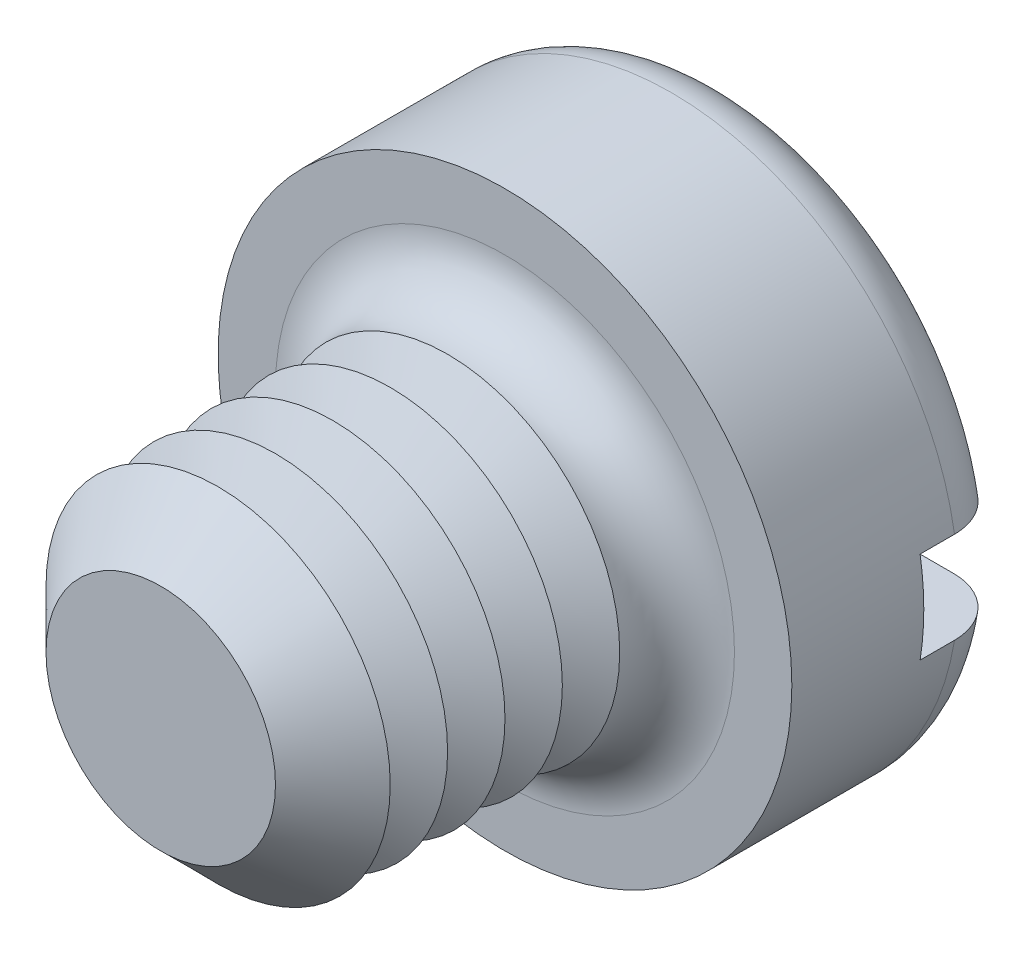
ISO-10303-21;
HEADER;
FILE_DESCRIPTION(('STEP AP214'),'2;1');
FILE_NAME('part.step','',(''),(''),'','','');
FILE_SCHEMA(('AUTOMOTIVE_DESIGN { 1 0 10303 214 1 1 1 1 }'));
ENDSEC;
DATA;
#1=APPLICATION_CONTEXT('core data for automotive mechanical design processes');
#2=APPLICATION_PROTOCOL_DEFINITION('international standard','automotive_design',2000,#1);
#3=PRODUCT_CONTEXT('',#1,'mechanical');
#4=PRODUCT('Part','Part','',(#3));
#5=PRODUCT_RELATED_PRODUCT_CATEGORY('part','',(#4));
#6=PRODUCT_DEFINITION_FORMATION('','',#4);
#7=PRODUCT_DEFINITION_CONTEXT('part definition',#1,'design');
#8=PRODUCT_DEFINITION('design','',#6,#7);
#9=PRODUCT_DEFINITION_SHAPE('','',#8);
#10=(LENGTH_UNIT() NAMED_UNIT(*) SI_UNIT(.MILLI.,.METRE.));
#11=(NAMED_UNIT(*) PLANE_ANGLE_UNIT() SI_UNIT($,.RADIAN.));
#12=(NAMED_UNIT(*) SI_UNIT($,.STERADIAN.) SOLID_ANGLE_UNIT());
#13=UNCERTAINTY_MEASURE_WITH_UNIT(LENGTH_MEASURE(1.E-05),#10,'distance_accuracy_value','');
#14=(GEOMETRIC_REPRESENTATION_CONTEXT(3) GLOBAL_UNCERTAINTY_ASSIGNED_CONTEXT((#13)) GLOBAL_UNIT_ASSIGNED_CONTEXT((#10,
#11,#12)) REPRESENTATION_CONTEXT('',''));
#15=CARTESIAN_POINT('',(0.,0.,0.));
#16=DIRECTION('',(0.,0.,1.));
#17=DIRECTION('',(1.,0.,0.));
#18=AXIS2_PLACEMENT_3D('',#15,#16,#17);
#19=CARTESIAN_POINT('',(0.,0.,-3.9));
#20=DIRECTION('',(0.,0.,1.));
#21=DIRECTION('',(1.,0.,0.));
#22=AXIS2_PLACEMENT_3D('',#19,#20,#21);
#23=PLANE('',#22);
#24=CARTESIAN_POINT('',(0.,0.,-3.9));
#25=DIRECTION('',(0.,0.,1.));
#26=DIRECTION('',(1.,0.,0.));
#27=AXIS2_PLACEMENT_3D('',#24,#25,#26);
#28=CIRCLE('',#27,4.);
#29=CARTESIAN_POINT('',(-3.91918358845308,0.800000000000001,-3.9));
#30=VERTEX_POINT('',#29);
#31=CARTESIAN_POINT('',(3.91918358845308,0.799999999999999,-3.9));
#32=VERTEX_POINT('',#31);
#33=EDGE_CURVE('E116',#30,#32,#28,.F.);
#34=ORIENTED_EDGE('',*,*,#33,.T.);
#35=DIRECTION('',(1.,0.,0.));
#36=VECTOR('',#35,1.);
#37=CARTESIAN_POINT('',(-5.,0.800000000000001,-3.9));
#38=LINE('',#37,#36);
#39=EDGE_CURVE('E111',#30,#32,#38,.T.);
#40=ORIENTED_EDGE('',*,*,#39,.F.);
#41=EDGE_LOOP('',(#34,#40));
#42=FACE_BOUND('',#41,.T.);
#43=ADVANCED_FACE('F39',(#42),#23,.F.);
#44=CARTESIAN_POINT('',(0.,0.,-2.9));
#45=DIRECTION('',(0.,0.,1.));
#46=DIRECTION('',(1.,0.,0.));
#47=AXIS2_PLACEMENT_3D('',#44,#45,#46);
#48=TOROIDAL_SURFACE('',#47,4.,1.);
#49=CARTESIAN_POINT('',(-4.76648512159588,0.800000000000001,-3.45304061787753));
#50=CARTESIAN_POINT('',(-4.73486405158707,0.800000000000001,-3.50001565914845));
#51=CARTESIAN_POINT('',(-4.69920787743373,0.800000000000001,-3.54432871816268));
#52=CARTESIAN_POINT('',(-4.62090302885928,0.800000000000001,-3.62634638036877));
#53=CARTESIAN_POINT('',(-4.57824494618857,0.800000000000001,-3.66404194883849));
#54=CARTESIAN_POINT('',(-4.48726975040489,0.800000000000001,-3.73172278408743));
#55=CARTESIAN_POINT('',(-4.43895902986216,0.800000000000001,-3.76171664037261));
#56=CARTESIAN_POINT('',(-4.33804923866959,0.800000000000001,-3.81326437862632));
#57=CARTESIAN_POINT('',(-4.2854512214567,0.800000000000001,-3.8348203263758));
#58=CARTESIAN_POINT('',(-4.17679895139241,0.800000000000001,-3.86918431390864));
#59=CARTESIAN_POINT('',(-4.12071163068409,0.800000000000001,-3.88188775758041));
#60=CARTESIAN_POINT('',(-4.00720729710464,0.800000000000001,-3.89785932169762));
#61=CARTESIAN_POINT('',(-3.94979011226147,0.800000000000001,-3.9011262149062));
#62=CARTESIAN_POINT('',(-3.83429042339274,0.800000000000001,-3.89816676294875));
#63=CARTESIAN_POINT('',(-3.77621176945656,0.8,-3.89178937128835));
#64=CARTESIAN_POINT('',(-3.66191938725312,0.8,-3.8694726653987));
#65=CARTESIAN_POINT('',(-3.60570580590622,0.8,-3.85353259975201));
#66=CARTESIAN_POINT('',(-3.49618749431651,0.8,-3.81233202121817));
#67=CARTESIAN_POINT('',(-3.44291561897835,0.8,-3.78698406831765));
#68=CARTESIAN_POINT('',(-3.34140774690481,0.8,-3.72766098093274));
#69=CARTESIAN_POINT('',(-3.29317182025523,0.8,-3.69368572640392));
#70=CARTESIAN_POINT('',(-3.20343355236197,0.8,-3.6182054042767));
#71=CARTESIAN_POINT('',(-3.16189680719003,0.8,-3.57674128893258));
#72=CARTESIAN_POINT('',(-3.08658236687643,0.8,-3.48727547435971));
#73=CARTESIAN_POINT('',(-3.05280364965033,0.8,-3.43927463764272));
#74=CARTESIAN_POINT('',(-2.99489532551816,0.8,-3.33932895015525));
#75=CARTESIAN_POINT('',(-2.97055012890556,0.8,-3.28750911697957));
#76=CARTESIAN_POINT('',(-2.93124252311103,0.8,-3.18042600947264));
#77=CARTESIAN_POINT('',(-2.91627793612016,0.8,-3.12516353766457));
#78=CARTESIAN_POINT('',(-2.89663075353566,0.8,-3.01470560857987));
#79=CARTESIAN_POINT('',(-2.89162828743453,0.8,-2.95956691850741));
#80=CARTESIAN_POINT('',(-2.89112479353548,0.8,-2.84924961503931));
#81=CARTESIAN_POINT('',(-2.89562264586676,0.8,-2.79407100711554));
#82=CARTESIAN_POINT('',(-2.91379565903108,0.8,-2.6861912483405));
#83=CARTESIAN_POINT('',(-2.92731815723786,0.8,-2.63346424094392));
#84=CARTESIAN_POINT('',(-2.96290888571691,0.8,-2.53098203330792));
#85=CARTESIAN_POINT('',(-2.98497757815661,0.8,-2.48122699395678));
#86=CARTESIAN_POINT('',(-3.03728055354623,0.8,-2.38535286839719));
#87=CARTESIAN_POINT('',(-3.06761989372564,0.8,-2.33929117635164));
#88=CARTESIAN_POINT('',(-3.13537950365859,0.8,-2.2527125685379));
#89=CARTESIAN_POINT('',(-3.17280082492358,0.8,-2.21219647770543));
#90=CARTESIAN_POINT('',(-3.2549164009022,0.8,-2.13651195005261));
#91=CARTESIAN_POINT('',(-3.29980186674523,0.8,-2.10155095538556));
#92=CARTESIAN_POINT('',(-3.39467666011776,0.8,-2.03942270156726));
#93=CARTESIAN_POINT('',(-3.44466673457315,0.8,-2.01225658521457));
#94=CARTESIAN_POINT('',(-3.5497933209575,0.8,-1.96576935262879));
#95=CARTESIAN_POINT('',(-3.60503228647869,0.8,-1.94667963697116));
#96=CARTESIAN_POINT('',(-3.71791613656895,0.8,-1.91794308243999));
#97=CARTESIAN_POINT('',(-3.77556119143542,0.800000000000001,-1.90829691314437));
#98=CARTESIAN_POINT('',(-3.89221522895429,0.800000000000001,-1.89869331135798));
#99=CARTESIAN_POINT('',(-3.9512319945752,0.800000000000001,-1.89882985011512));
#100=CARTESIAN_POINT('',(-4.06839541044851,0.800000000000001,-1.90907818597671));
#101=CARTESIAN_POINT('',(-4.12654207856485,0.800000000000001,-1.91918977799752));
#102=CARTESIAN_POINT('',(-4.23988103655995,0.800000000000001,-1.9490667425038));
#103=CARTESIAN_POINT('',(-4.29509069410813,0.800000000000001,-1.96876615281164));
#104=CARTESIAN_POINT('',(-4.40134194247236,0.800000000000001,-2.01729572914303));
#105=CARTESIAN_POINT('',(-4.45238383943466,0.800000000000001,-2.04612522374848));
#106=CARTESIAN_POINT('',(-4.54801343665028,0.800000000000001,-2.1116316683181));
#107=CARTESIAN_POINT('',(-4.59268768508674,0.800000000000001,-2.14818225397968));
#108=CARTESIAN_POINT('',(-4.67513924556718,0.800000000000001,-2.22837632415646));
#109=CARTESIAN_POINT('',(-4.71291715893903,0.800000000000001,-2.27201918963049));
#110=CARTESIAN_POINT('',(-4.77986554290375,0.800000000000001,-2.36439990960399));
#111=CARTESIAN_POINT('',(-4.80916462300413,0.800000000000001,-2.41304457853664));
#112=CARTESIAN_POINT('',(-4.85906149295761,0.800000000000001,-2.51460659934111));
#113=CARTESIAN_POINT('',(-4.8796602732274,0.800000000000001,-2.56752346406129));
#114=CARTESIAN_POINT('',(-4.9113264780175,0.800000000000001,-2.67542592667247));
#115=CARTESIAN_POINT('',(-4.92250819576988,0.800000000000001,-2.73037800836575));
#116=CARTESIAN_POINT('',(-4.93542682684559,0.800000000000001,-2.84139649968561));
#117=CARTESIAN_POINT('',(-4.93716171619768,0.800000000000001,-2.89746314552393));
#118=CARTESIAN_POINT('',(-4.93114851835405,0.800000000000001,-3.00876455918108));
#119=CARTESIAN_POINT('',(-4.92345325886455,0.800000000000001,-3.0640022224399));
#120=CARTESIAN_POINT('',(-4.8989032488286,0.800000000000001,-3.17235240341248));
#121=CARTESIAN_POINT('',(-4.88205998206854,0.800000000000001,-3.22546749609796));
#122=CARTESIAN_POINT('',(-4.84819200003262,0.800000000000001,-3.30764066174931));
#123=CARTESIAN_POINT('',(-4.83390853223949,0.800000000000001,-3.33785845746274));
#124=CARTESIAN_POINT('',(-4.80237957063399,0.800000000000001,-3.39670633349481));
#125=CARTESIAN_POINT('',(-4.78513409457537,0.800000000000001,-3.42533642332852));
#126=CARTESIAN_POINT('',(-4.76648512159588,0.800000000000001,-3.45304061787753));
#127=B_SPLINE_CURVE_WITH_KNOTS('',3,(#49,#50,#51,#52,#53,#54,#55,#56,#57,#58,#59,#60,#61,#62,
#63,#64,#65,#66,#67,#68,#69,#70,#71,#72,#73,#74,#75,#76,#77,#78,#79,#80,#81,#82,#83,#84,#85,#86,
#87,#88,#89,#90,#91,#92,#93,#94,#95,#96,#97,#98,#99,#100,#101,#102,#103,#104,#105,#106,#107,
#108,#109,#110,#111,#112,#113,#114,#115,#116,#117,#118,#119,#120,#121,#122,#123,#124,#125,#126),
.UNSPECIFIED.,.T.,.F.,(4,2,2,2,2,2,2,2,2,2,2,2,2,2,2,2,2,2,2,2,2,2,2,2,2,2,2,2,2,2,2,2,2,2,2,2,
2,2,4),(0.,0.169755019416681,0.339740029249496,0.509534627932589,0.67928763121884,
0.851013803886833,1.02276230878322,1.19722869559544,1.37170879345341,1.54785292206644,
1.72399950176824,1.89921049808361,2.07439839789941,2.24530597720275,2.41617386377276,
2.58146078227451,2.74672821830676,2.90926852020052,3.0718176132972,3.2365363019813,
3.40127946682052,3.57118676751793,3.74111896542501,3.91563534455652,4.09016409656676,
4.26636956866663,4.4425714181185,4.61757781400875,4.79257134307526,4.96489650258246,
5.13720662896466,5.30674670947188,5.47626748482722,5.64369988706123,5.81116816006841,
5.97770254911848,6.14402836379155,6.24414438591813,6.34425980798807),.UNSPECIFIED.);
#128=CARTESIAN_POINT('',(-4.93558507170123,0.800000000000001,-2.9));
#129=VERTEX_POINT('',#128);
#130=EDGE_CURVE('E211',#129,#30,#127,.T.);
#131=ORIENTED_EDGE('',*,*,#130,.F.);
#132=CARTESIAN_POINT('',(0.,0.,-2.9));
#133=DIRECTION('',(0.,0.,1.));
#134=DIRECTION('',(1.,0.,0.));
#135=AXIS2_PLACEMENT_3D('',#132,#133,#134);
#136=CIRCLE('',#135,5.);
#137=CARTESIAN_POINT('',(4.93558507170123,0.799999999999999,-2.9));
#138=VERTEX_POINT('',#137);
#139=EDGE_CURVE('E125',#138,#129,#136,.T.);
#140=ORIENTED_EDGE('',*,*,#139,.F.);
#141=CARTESIAN_POINT('',(2.98553785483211,0.8,-3.31649797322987));
#142=CARTESIAN_POINT('',(3.00991125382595,0.8,-3.36788093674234));
#143=CARTESIAN_POINT('',(3.03875556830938,0.8,-3.41719756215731));
#144=CARTESIAN_POINT('',(3.1043993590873,0.8,-3.51028676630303));
#145=CARTESIAN_POINT('',(3.1412115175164,0.8,-3.55405032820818));
#146=CARTESIAN_POINT('',(3.22153641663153,0.8,-3.63476402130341));
#147=CARTESIAN_POINT('',(3.26503706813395,0.8,-3.67172618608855));
#148=CARTESIAN_POINT('',(3.35749627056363,0.8,-3.73799476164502));
#149=CARTESIAN_POINT('',(3.4064533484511,0.8,-3.76730323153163));
#150=CARTESIAN_POINT('',(3.5095773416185,0.8,-3.81809642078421));
#151=CARTESIAN_POINT('',(3.56383317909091,0.8,-3.83940072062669));
#152=CARTESIAN_POINT('',(3.67513017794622,0.8,-3.87272481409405));
#153=CARTESIAN_POINT('',(3.7321717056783,0.799999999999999,-3.88474338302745));
#154=CARTESIAN_POINT('',(3.84815688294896,0.799999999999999,-3.89923413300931));
#155=CARTESIAN_POINT('',(3.90711516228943,0.799999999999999,-3.9015896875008));
#156=CARTESIAN_POINT('',(4.02458610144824,0.799999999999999,-3.89631753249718));
#157=CARTESIAN_POINT('',(4.08309876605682,0.799999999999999,-3.8886899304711));
#158=CARTESIAN_POINT('',(4.19768646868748,0.799999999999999,-3.86366584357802));
#159=CARTESIAN_POINT('',(4.25377243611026,0.799999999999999,-3.84631948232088));
#160=CARTESIAN_POINT('',(4.3621676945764,0.799999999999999,-3.80231797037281));
#161=CARTESIAN_POINT('',(4.41447726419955,0.799999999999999,-3.77566350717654));
#162=CARTESIAN_POINT('',(4.51300872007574,0.799999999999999,-3.71421163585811));
#163=CARTESIAN_POINT('',(4.5593085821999,0.799999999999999,-3.67953927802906));
#164=CARTESIAN_POINT('',(4.64530675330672,0.799999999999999,-3.60279495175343));
#165=CARTESIAN_POINT('',(4.68500564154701,0.799999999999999,-3.56072363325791));
#166=CARTESIAN_POINT('',(4.75599202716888,0.799999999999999,-3.47111750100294));
#167=CARTESIAN_POINT('',(4.7874061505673,0.799999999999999,-3.42368298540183));
#168=CARTESIAN_POINT('',(4.84170328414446,0.799999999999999,-3.32415927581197));
#169=CARTESIAN_POINT('',(4.86458695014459,0.799999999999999,-3.2720704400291));
#170=CARTESIAN_POINT('',(4.90088120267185,0.799999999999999,-3.16544016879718));
#171=CARTESIAN_POINT('',(4.91440984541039,0.799999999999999,-3.11093889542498));
#172=CARTESIAN_POINT('',(4.93205429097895,0.799999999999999,-3.00043391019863));
#173=CARTESIAN_POINT('',(4.93617053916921,0.799999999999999,-2.9444302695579));
#174=CARTESIAN_POINT('',(4.93486973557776,0.799999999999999,-2.83292218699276));
#175=CARTESIAN_POINT('',(4.92951827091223,0.799999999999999,-2.77741696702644));
#176=CARTESIAN_POINT('',(4.90957104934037,0.799999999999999,-2.66809456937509));
#177=CARTESIAN_POINT('',(4.89497541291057,0.799999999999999,-2.61427736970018));
#178=CARTESIAN_POINT('',(4.85697876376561,0.799999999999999,-2.50985095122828));
#179=CARTESIAN_POINT('',(4.83357805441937,0.799999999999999,-2.45924162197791));
#180=CARTESIAN_POINT('',(4.77866660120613,0.799999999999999,-2.36263484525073));
#181=CARTESIAN_POINT('',(4.74715567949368,0.799999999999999,-2.31663749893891));
#182=CARTESIAN_POINT('',(4.67670791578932,0.799999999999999,-2.23021464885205));
#183=CARTESIAN_POINT('',(4.6377224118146,0.799999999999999,-2.1898288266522));
#184=CARTESIAN_POINT('',(4.55359880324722,0.799999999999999,-2.11607828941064));
#185=CARTESIAN_POINT('',(4.50846036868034,0.799999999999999,-2.08271395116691));
#186=CARTESIAN_POINT('',(4.41271544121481,0.799999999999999,-2.02349513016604));
#187=CARTESIAN_POINT('',(4.36204749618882,0.799999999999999,-1.99774003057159));
#188=CARTESIAN_POINT('',(4.257155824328,0.799999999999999,-1.95495040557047));
#189=CARTESIAN_POINT('',(4.20293181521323,0.799999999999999,-1.93791657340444));
#190=CARTESIAN_POINT('',(4.09154156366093,0.799999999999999,-1.91276335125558));
#191=CARTESIAN_POINT('',(4.03434212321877,0.799999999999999,-1.90479098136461));
#192=CARTESIAN_POINT('',(3.91941228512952,0.799999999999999,-1.89840884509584));
#193=CARTESIAN_POINT('',(3.8616818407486,0.799999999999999,-1.89999992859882));
#194=CARTESIAN_POINT('',(3.7464111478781,0.799999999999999,-1.91275144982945));
#195=CARTESIAN_POINT('',(3.6888866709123,0.8,-1.92405471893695));
#196=CARTESIAN_POINT('',(3.57652290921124,0.8,-1.95609086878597));
#197=CARTESIAN_POINT('',(3.52168382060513,0.8,-1.97682443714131));
#198=CARTESIAN_POINT('',(3.41589179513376,0.8,-2.02733294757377));
#199=CARTESIAN_POINT('',(3.36496676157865,0.8,-2.05716640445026));
#200=CARTESIAN_POINT('',(3.26890903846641,0.8,-2.12504079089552));
#201=CARTESIAN_POINT('',(3.22377627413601,0.8,-2.16308161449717));
#202=CARTESIAN_POINT('',(3.141135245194,0.8,-2.24593284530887));
#203=CARTESIAN_POINT('',(3.1035541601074,0.8,-2.29067053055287));
#204=CARTESIAN_POINT('',(3.03669700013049,0.8,-2.38597317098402));
#205=CARTESIAN_POINT('',(3.00741914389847,0.8,-2.43653687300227));
#206=CARTESIAN_POINT('',(2.95891799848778,0.8,-2.54052959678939));
#207=CARTESIAN_POINT('',(2.93943249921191,0.8,-2.59383627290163));
#208=CARTESIAN_POINT('',(2.9100081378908,0.8,-2.70303736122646));
#209=CARTESIAN_POINT('',(2.90006970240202,0.8,-2.75893188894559));
#210=CARTESIAN_POINT('',(2.89027863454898,0.8,-2.86986958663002));
#211=CARTESIAN_POINT('',(2.89012791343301,0.8,-2.92488680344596));
#212=CARTESIAN_POINT('',(2.89917145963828,0.8,-3.03409648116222));
#213=CARTESIAN_POINT('',(2.90835313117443,0.8,-3.08828995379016));
#214=CARTESIAN_POINT('',(2.92977618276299,0.8,-3.17141652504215));
#215=CARTESIAN_POINT('',(2.93899011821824,0.8,-3.20116372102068));
#216=CARTESIAN_POINT('',(2.96020249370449,0.8,-3.25964614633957));
#217=CARTESIAN_POINT('',(2.97220082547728,0.8,-3.28838141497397));
#218=CARTESIAN_POINT('',(2.98553785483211,0.8,-3.31649797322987));
#219=B_SPLINE_CURVE_WITH_KNOTS('',3,(#141,#142,#143,#144,#145,#146,#147,#148,#149,#150,#151,
#152,#153,#154,#155,#156,#157,#158,#159,#160,#161,#162,#163,#164,#165,#166,#167,#168,#169,#170,
#171,#172,#173,#174,#175,#176,#177,#178,#179,#180,#181,#182,#183,#184,#185,#186,#187,#188,#189,
#190,#191,#192,#193,#194,#195,#196,#197,#198,#199,#200,#201,#202,#203,#204,#205,#206,#207,#208,
#209,#210,#211,#212,#213,#214,#215,#216,#217,#218),.UNSPECIFIED.,.T.,.F.,(4,2,2,2,2,2,2,2,2,2,2,
2,2,2,2,2,2,2,2,2,2,2,2,2,2,2,2,2,2,2,2,2,2,2,2,2,2,2,4),(0.,0.170493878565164,
0.341261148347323,0.511723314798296,0.682139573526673,0.856194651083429,1.03027268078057,
1.20644565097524,1.38261672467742,1.55788746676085,1.73314526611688,1.90583484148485,
2.07850925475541,2.24836742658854,2.41821253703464,2.58587311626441,2.75352576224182,
2.92002154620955,3.08651516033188,3.25300303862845,3.41949456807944,3.58710926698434,
3.75473295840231,3.92445790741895,4.09419634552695,4.26665110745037,4.43912119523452,
4.61417197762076,4.78923552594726,4.96544940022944,5.1416609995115,5.31608191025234,
5.49046537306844,5.65989063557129,5.82932346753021,5.99359365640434,6.157642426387,
6.25093964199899,6.34423323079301),.UNSPECIFIED.);
#220=EDGE_CURVE('E213',#32,#138,#219,.T.);
#221=ORIENTED_EDGE('',*,*,#220,.F.);
#222=ORIENTED_EDGE('',*,*,#33,.F.);
#223=EDGE_LOOP('',(#131,#140,#221,#222));
#224=FACE_BOUND('',#223,.T.);
#225=ADVANCED_FACE('F195',(#224),#48,.T.);
#226=CARTESIAN_POINT('',(0.,0.,-3.9));
#227=DIRECTION('',(0.,0.,1.));
#228=DIRECTION('',(1.,0.,0.));
#229=AXIS2_PLACEMENT_3D('',#226,#227,#228);
#230=CYLINDRICAL_SURFACE('',#229,5.);
#231=DIRECTION('',(0.,0.,1.));
#232=VECTOR('',#231,1.);
#233=CARTESIAN_POINT('',(4.93558507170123,0.799999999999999,-3.9));
#234=LINE('',#233,#232);
#235=CARTESIAN_POINT('',(4.93558507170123,0.799999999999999,-2.3));
#236=VERTEX_POINT('',#235);
#237=EDGE_CURVE('E228',#138,#236,#234,.T.);
#238=ORIENTED_EDGE('',*,*,#237,.F.);
#239=ORIENTED_EDGE('',*,*,#139,.T.);
#240=DIRECTION('',(0.,0.,1.));
#241=VECTOR('',#240,1.);
#242=CARTESIAN_POINT('',(-4.93558507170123,0.800000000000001,-3.9));
#243=LINE('',#242,#241);
#244=CARTESIAN_POINT('',(-4.93558507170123,0.800000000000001,-2.3));
#245=VERTEX_POINT('',#244);
#246=EDGE_CURVE('E63',#245,#129,#243,.F.);
#247=ORIENTED_EDGE('',*,*,#246,.F.);
#248=CARTESIAN_POINT('',(0.,0.,-2.3));
#249=DIRECTION('',(0.,0.,-1.));
#250=DIRECTION('',(-1.,0.,0.));
#251=AXIS2_PLACEMENT_3D('',#248,#249,#250);
#252=CIRCLE('',#251,5.);
#253=CARTESIAN_POINT('',(-4.93558507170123,-0.799999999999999,-2.3));
#254=VERTEX_POINT('',#253);
#255=EDGE_CURVE('E43',#245,#254,#252,.F.);
#256=ORIENTED_EDGE('',*,*,#255,.T.);
#257=DIRECTION('',(0.,0.,1.));
#258=VECTOR('',#257,1.);
#259=CARTESIAN_POINT('',(-4.93558507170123,-0.799999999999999,-3.9));
#260=LINE('',#259,#258);
#261=CARTESIAN_POINT('',(-4.93558507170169,-0.799999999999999,-2.89999999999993));
#262=VERTEX_POINT('',#261);
#263=EDGE_CURVE('E226',#262,#254,#260,.T.);
#264=ORIENTED_EDGE('',*,*,#263,.F.);
#265=CARTESIAN_POINT('',(4.93558507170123,-0.800000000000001,-2.9));
#266=VERTEX_POINT('',#265);
#267=EDGE_CURVE('E127',#262,#266,#136,.T.);
#268=ORIENTED_EDGE('',*,*,#267,.T.);
#269=DIRECTION('',(0.,0.,1.));
#270=VECTOR('',#269,1.);
#271=CARTESIAN_POINT('',(4.93558507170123,-0.800000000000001,-3.9));
#272=LINE('',#271,#270);
#273=CARTESIAN_POINT('',(4.93558507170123,-0.800000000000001,-2.3));
#274=VERTEX_POINT('',#273);
#275=EDGE_CURVE('E55',#274,#266,#272,.F.);
#276=ORIENTED_EDGE('',*,*,#275,.F.);
#277=EDGE_CURVE('E11',#274,#236,#252,.F.);
#278=ORIENTED_EDGE('',*,*,#277,.T.);
#279=EDGE_LOOP('',(#238,#239,#247,#256,#264,#268,#276,#278));
#280=FACE_BOUND('',#279,.T.);
#281=CARTESIAN_POINT('',(0.,0.,0.));
#282=DIRECTION('',(0.,0.,1.));
#283=DIRECTION('',(1.,0.,0.));
#284=AXIS2_PLACEMENT_3D('',#281,#282,#283);
#285=CIRCLE('',#284,5.);
#286=CARTESIAN_POINT('',(5.,0.,0.));
#287=VERTEX_POINT('',#286);
#288=EDGE_CURVE('E230',#287,#287,#285,.T.);
#289=ORIENTED_EDGE('',*,*,#288,.F.);
#290=EDGE_LOOP('',(#289));
#291=FACE_BOUND('',#290,.T.);
#292=ADVANCED_FACE('F191',(#280,#291),#230,.T.);
#293=CARTESIAN_POINT('',(3.91918358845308,-0.800000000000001,-3.9));
#294=VERTEX_POINT('',#293);
#295=CARTESIAN_POINT('',(-3.91918358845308,-0.799999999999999,-3.9));
#296=VERTEX_POINT('',#295);
#297=EDGE_CURVE('E109',#294,#296,#28,.F.);
#298=ORIENTED_EDGE('',*,*,#297,.T.);
#299=DIRECTION('',(-1.,0.,0.));
#300=VECTOR('',#299,1.);
#301=CARTESIAN_POINT('',(-5.,-0.799999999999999,-3.9));
#302=LINE('',#301,#300);
#303=EDGE_CURVE('E96',#294,#296,#302,.T.);
#304=ORIENTED_EDGE('',*,*,#303,.F.);
#305=EDGE_LOOP('',(#298,#304));
#306=FACE_BOUND('',#305,.T.);
#307=ADVANCED_FACE('F108',(#306),#23,.F.);
#308=CARTESIAN_POINT('',(0.,0.,0.));
#309=DIRECTION('',(0.,0.,1.));
#310=DIRECTION('',(1.,0.,0.));
#311=AXIS2_PLACEMENT_3D('',#308,#309,#310);
#312=PLANE('',#311);
#313=CARTESIAN_POINT('',(0.,0.,0.));
#314=DIRECTION('',(0.,0.,1.));
#315=DIRECTION('',(1.,0.,0.));
#316=AXIS2_PLACEMENT_3D('',#313,#314,#315);
#317=CIRCLE('',#316,4.);
#318=CARTESIAN_POINT('',(4.,0.,0.));
#319=VERTEX_POINT('',#318);
#320=EDGE_CURVE('E115',#319,#319,#317,.F.);
#321=ORIENTED_EDGE('',*,*,#320,.T.);
#322=EDGE_LOOP('',(#321));
#323=FACE_BOUND('',#322,.T.);
#324=ORIENTED_EDGE('',*,*,#288,.T.);
#325=EDGE_LOOP('',(#324));
#326=FACE_BOUND('',#325,.T.);
#327=ADVANCED_FACE('F190',(#323,#326),#312,.T.);
#328=CARTESIAN_POINT('',(-4.76648512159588,-0.799999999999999,-3.45304061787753));
#329=CARTESIAN_POINT('',(-4.7975694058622,-0.799999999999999,-3.40685392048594));
#330=CARTESIAN_POINT('',(-4.82479903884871,-0.799999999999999,-3.35802740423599));
#331=CARTESIAN_POINT('',(-4.87070632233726,-0.799999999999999,-3.25646127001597));
#332=CARTESIAN_POINT('',(-4.8893747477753,-0.799999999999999,-3.20371750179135));
#333=CARTESIAN_POINT('',(-4.91756720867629,-0.799999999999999,-3.09584501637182));
#334=CARTESIAN_POINT('',(-4.92709302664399,-0.799999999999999,-3.04071676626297));
#335=CARTESIAN_POINT('',(-4.93671217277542,-0.799999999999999,-2.92965669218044));
#336=CARTESIAN_POINT('',(-4.93680767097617,-0.799999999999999,-2.87372505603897));
#337=CARTESIAN_POINT('',(-4.92758675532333,-0.799999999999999,-2.76284675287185));
#338=CARTESIAN_POINT('',(-4.91830421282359,-0.799999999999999,-2.70789726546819));
#339=CARTESIAN_POINT('',(-4.89065741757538,-0.799999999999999,-2.60033228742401));
#340=CARTESIAN_POINT('',(-4.87229291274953,-0.799999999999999,-2.54771686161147));
#341=CARTESIAN_POINT('',(-4.82699855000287,-0.799999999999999,-2.44622441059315));
#342=CARTESIAN_POINT('',(-4.80005659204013,-0.799999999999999,-2.39735278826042));
#343=CARTESIAN_POINT('',(-4.73841244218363,-0.799999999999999,-2.30477947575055));
#344=CARTESIAN_POINT('',(-4.70371003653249,-0.799999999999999,-2.26107792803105));
#345=CARTESIAN_POINT('',(-4.62724516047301,-0.799999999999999,-2.17969334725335));
#346=CARTESIAN_POINT('',(-4.58542787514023,-0.799999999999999,-2.14206183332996));
#347=CARTESIAN_POINT('',(-4.49614171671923,-0.799999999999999,-2.07424284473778));
#348=CARTESIAN_POINT('',(-4.44867251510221,-0.799999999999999,-2.04405580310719));
#349=CARTESIAN_POINT('',(-4.34875035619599,-0.799999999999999,-1.99153688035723));
#350=CARTESIAN_POINT('',(-4.29623870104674,-0.799999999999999,-1.96931670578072));
#351=CARTESIAN_POINT('',(-4.18826905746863,-0.799999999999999,-1.93384994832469));
#352=CARTESIAN_POINT('',(-4.1328108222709,-0.799999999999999,-1.92060411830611));
#353=CARTESIAN_POINT('',(-4.01956054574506,-0.799999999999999,-1.90323798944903));
#354=CARTESIAN_POINT('',(-3.96174522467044,-0.799999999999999,-1.89926947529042));
#355=CARTESIAN_POINT('',(-3.84625419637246,-0.799999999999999,-1.90095183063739));
#356=CARTESIAN_POINT('',(-3.78857850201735,-0.8,-1.90660355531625));
#357=CARTESIAN_POINT('',(-3.67415602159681,-0.8,-1.92748272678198));
#358=CARTESIAN_POINT('',(-3.61743328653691,-0.8,-1.94284216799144));
#359=CARTESIAN_POINT('',(-3.50734962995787,-0.8,-1.9828275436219));
#360=CARTESIAN_POINT('',(-3.45398891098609,-0.8,-2.00745403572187));
#361=CARTESIAN_POINT('',(-3.35197118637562,-0.8,-2.06542964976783));
#362=CARTESIAN_POINT('',(-3.30333217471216,-0.8,-2.0988104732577));
#363=CARTESIAN_POINT('',(-3.21244692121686,-0.8,-2.17337326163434));
#364=CARTESIAN_POINT('',(-3.17020039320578,-0.8,-2.21455487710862));
#365=CARTESIAN_POINT('',(-3.0940098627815,-0.8,-2.30296695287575));
#366=CARTESIAN_POINT('',(-3.05995540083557,-0.8,-2.35010211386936));
#367=CARTESIAN_POINT('',(-3.00053815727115,-0.8,-2.4495670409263));
#368=CARTESIAN_POINT('',(-2.97517362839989,-0.8,-2.50189576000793));
#369=CARTESIAN_POINT('',(-2.93470320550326,-0.8,-2.60853979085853));
#370=CARTESIAN_POINT('',(-2.91930557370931,-0.8,-2.66274437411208));
#371=CARTESIAN_POINT('',(-2.8981273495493,-0.8,-2.77299836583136));
#372=CARTESIAN_POINT('',(-2.89234481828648,-0.8,-2.82904740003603));
#373=CARTESIAN_POINT('',(-2.89064073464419,-0.8,-2.93970612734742));
#374=CARTESIAN_POINT('',(-2.89444549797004,-0.8,-2.99431180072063));
#375=CARTESIAN_POINT('',(-2.9112006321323,-0.8,-3.10209766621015));
#376=CARTESIAN_POINT('',(-2.9241507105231,-0.8,-3.1552779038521));
#377=CARTESIAN_POINT('',(-2.95868580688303,-0.8,-3.25858631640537));
#378=CARTESIAN_POINT('',(-2.98024709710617,-0.8,-3.30872244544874));
#379=CARTESIAN_POINT('',(-3.03128544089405,-0.8,-3.40478519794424));
#380=CARTESIAN_POINT('',(-3.06076335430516,-0.8,-3.45071136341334));
#381=CARTESIAN_POINT('',(-3.12753448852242,-0.8,-3.53826932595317));
#382=CARTESIAN_POINT('',(-3.16500083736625,-0.8,-3.57976901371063));
#383=CARTESIAN_POINT('',(-3.24617503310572,-0.8,-3.65613204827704));
#384=CARTESIAN_POINT('',(-3.28988388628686,-0.8,-3.69099432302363));
#385=CARTESIAN_POINT('',(-3.38380639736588,-0.8,-3.75424083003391));
#386=CARTESIAN_POINT('',(-3.43418287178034,-0.8,-3.78238342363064));
#387=CARTESIAN_POINT('',(-3.53887888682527,-0.8,-3.83000231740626));
#388=CARTESIAN_POINT('',(-3.59319889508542,-0.8,-3.84947758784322));
#389=CARTESIAN_POINT('',(-3.70539237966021,-0.8,-3.87954336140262));
#390=CARTESIAN_POINT('',(-3.76331464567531,-0.799999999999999,-3.88995217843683));
#391=CARTESIAN_POINT('',(-3.88008461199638,-0.799999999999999,-3.9009132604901));
#392=CARTESIAN_POINT('',(-3.93893230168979,-0.799999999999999,-3.9014656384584));
#393=CARTESIAN_POINT('',(-4.05594892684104,-0.799999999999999,-3.89264187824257));
#394=CARTESIAN_POINT('',(-4.11411702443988,-0.799999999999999,-3.88325457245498));
#395=CARTESIAN_POINT('',(-4.22802928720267,-0.799999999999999,-3.85472582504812));
#396=CARTESIAN_POINT('',(-4.28377297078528,-0.799999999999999,-3.83558245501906));
#397=CARTESIAN_POINT('',(-4.39054463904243,-0.799999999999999,-3.78829842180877));
#398=CARTESIAN_POINT('',(-4.44161887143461,-0.799999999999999,-3.76026208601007));
#399=CARTESIAN_POINT('',(-4.53818016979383,-0.799999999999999,-3.69589278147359));
#400=CARTESIAN_POINT('',(-4.58367442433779,-0.799999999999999,-3.65957066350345));
#401=CARTESIAN_POINT('',(-4.65208830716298,-0.799999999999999,-3.59453310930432));
#402=CARTESIAN_POINT('',(-4.67711825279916,-0.799999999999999,-3.56800018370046));
#403=CARTESIAN_POINT('',(-4.72414423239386,-0.799999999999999,-3.51236863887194));
#404=CARTESIAN_POINT('',(-4.74614029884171,-0.799999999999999,-3.48327004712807));
#405=CARTESIAN_POINT('',(-4.76648512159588,-0.799999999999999,-3.45304061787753));
#406=B_SPLINE_CURVE_WITH_KNOTS('',3,(#328,#329,#330,#331,#332,#333,#334,#335,#336,#337,#338,
#339,#340,#341,#342,#343,#344,#345,#346,#347,#348,#349,#350,#351,#352,#353,#354,#355,#356,#357,
#358,#359,#360,#361,#362,#363,#364,#365,#366,#367,#368,#369,#370,#371,#372,#373,#374,#375,#376,
#377,#378,#379,#380,#381,#382,#383,#384,#385,#386,#387,#388,#389,#390,#391,#392,#393,#394,#395,
#396,#397,#398,#399,#400,#401,#402,#403,#404,#405),.UNSPECIFIED.,.T.,.F.,(4,2,2,2,2,2,2,2,2,2,2,
2,2,2,2,2,2,2,2,2,2,2,2,2,2,2,2,2,2,2,2,2,2,2,2,2,2,2,4),(0.,0.166886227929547,
0.333951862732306,0.500984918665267,0.667979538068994,0.834373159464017,1.00077139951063,
1.16740542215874,1.33404403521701,1.50202999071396,1.67002571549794,1.84029248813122,
2.01057354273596,2.18362161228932,2.35668506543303,2.53215380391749,2.70763310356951,
2.88375684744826,3.05987270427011,3.23346085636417,3.40701408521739,3.57522519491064,
3.74340238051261,3.90683338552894,4.07025916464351,4.2332377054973,4.39623395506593,
4.56320691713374,4.7302068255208,4.90252468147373,5.07486300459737,5.2505802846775,
5.42629555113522,5.60220844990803,5.77815613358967,5.95211162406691,6.12584060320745,
6.23506966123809,6.34429754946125),.UNSPECIFIED.);
#407=EDGE_CURVE('E103',#296,#262,#406,.T.);
#408=ORIENTED_EDGE('',*,*,#407,.F.);
#409=ORIENTED_EDGE('',*,*,#297,.F.);
#410=CARTESIAN_POINT('',(2.98553785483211,-0.8,-3.31649797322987));
#411=CARTESIAN_POINT('',(2.96216773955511,-0.8,-3.2672184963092));
#412=CARTESIAN_POINT('',(2.94287503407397,-0.8,-3.21596872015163));
#413=CARTESIAN_POINT('',(2.91313258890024,-0.8,-3.11092723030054));
#414=CARTESIAN_POINT('',(2.9026902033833,-0.8,-3.0571334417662));
#415=CARTESIAN_POINT('',(2.89104377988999,-0.8,-2.94853922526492));
#416=CARTESIAN_POINT('',(2.88984130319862,-0.8,-2.89373862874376));
#417=CARTESIAN_POINT('',(2.89672585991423,-0.8,-2.78473646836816));
#418=CARTESIAN_POINT('',(2.90481120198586,-0.8,-2.73053479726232));
#419=CARTESIAN_POINT('',(2.92989134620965,-0.8,-2.62460092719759));
#420=CARTESIAN_POINT('',(2.94682969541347,-0.8,-2.57285532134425));
#421=CARTESIAN_POINT('',(2.9889990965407,-0.8,-2.47286425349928));
#422=CARTESIAN_POINT('',(3.01423103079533,-0.8,-2.42461916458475));
#423=CARTESIAN_POINT('',(3.07271536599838,-0.8,-2.33201565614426));
#424=CARTESIAN_POINT('',(3.10610710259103,-0.8,-2.28774532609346));
#425=CARTESIAN_POINT('',(3.17963417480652,-0.8,-2.20521530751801));
#426=CARTESIAN_POINT('',(3.21977054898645,-0.8,-2.16695654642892));
#427=CARTESIAN_POINT('',(3.3070361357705,-0.8,-2.09624274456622));
#428=CARTESIAN_POINT('',(3.35434874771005,-0.8,-2.06401396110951));
#429=CARTESIAN_POINT('',(3.45361131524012,-0.8,-2.00773436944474));
#430=CARTESIAN_POINT('',(3.50556189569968,-0.8,-1.98368466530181));
#431=CARTESIAN_POINT('',(3.61398433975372,-0.8,-1.94389460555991));
#432=CARTESIAN_POINT('',(3.67053506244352,-0.8,-1.92836880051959));
#433=CARTESIAN_POINT('',(3.78543606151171,-0.8,-1.90696594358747));
#434=CARTESIAN_POINT('',(3.84378643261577,-0.800000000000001,-1.90108940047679));
#435=CARTESIAN_POINT('',(3.96100201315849,-0.800000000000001,-1.89918115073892));
#436=CARTESIAN_POINT('',(4.01986821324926,-0.800000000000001,-1.90320860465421));
#437=CARTESIAN_POINT('',(4.13606891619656,-0.800000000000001,-1.9211820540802));
#438=CARTESIAN_POINT('',(4.19340347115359,-0.800000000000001,-1.93512771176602));
#439=CARTESIAN_POINT('',(4.30434213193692,-0.800000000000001,-1.97243705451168));
#440=CARTESIAN_POINT('',(4.35797549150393,-0.800000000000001,-1.99571368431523));
#441=CARTESIAN_POINT('',(4.46048254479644,-0.800000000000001,-2.0510826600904));
#442=CARTESIAN_POINT('',(4.50935662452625,-0.800000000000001,-2.08317429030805));
#443=CARTESIAN_POINT('',(4.60012348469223,-0.800000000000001,-2.15471647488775));
#444=CARTESIAN_POINT('',(4.64211506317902,-0.800000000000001,-2.19404167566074));
#445=CARTESIAN_POINT('',(4.71877054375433,-0.800000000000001,-2.27928299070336));
#446=CARTESIAN_POINT('',(4.75343508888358,-0.800000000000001,-2.32519852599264));
#447=CARTESIAN_POINT('',(4.81388799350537,-0.800000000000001,-2.4215411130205));
#448=CARTESIAN_POINT('',(4.83980652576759,-0.800000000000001,-2.47188650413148));
#449=CARTESIAN_POINT('',(4.88271402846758,-0.800000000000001,-2.57624865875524));
#450=CARTESIAN_POINT('',(4.89970360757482,-0.800000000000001,-2.63026517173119));
#451=CARTESIAN_POINT('',(4.92409334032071,-0.800000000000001,-2.73978844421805));
#452=CARTESIAN_POINT('',(4.93159814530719,-0.800000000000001,-2.79527191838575));
#453=CARTESIAN_POINT('',(4.93713723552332,-0.800000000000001,-2.90670881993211));
#454=CARTESIAN_POINT('',(4.9351718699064,-0.800000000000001,-2.9626622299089));
#455=CARTESIAN_POINT('',(4.92186293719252,-0.800000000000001,-3.07317093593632));
#456=CARTESIAN_POINT('',(4.91056393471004,-0.800000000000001,-3.12773160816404));
#457=CARTESIAN_POINT('',(4.87898532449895,-0.800000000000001,-3.23418745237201));
#458=CARTESIAN_POINT('',(4.85870572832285,-0.800000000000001,-3.28608262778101));
#459=CARTESIAN_POINT('',(4.80971634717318,-0.800000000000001,-3.38586723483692));
#460=CARTESIAN_POINT('',(4.78098824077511,-0.800000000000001,-3.43374766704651));
#461=CARTESIAN_POINT('',(4.71596686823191,-0.800000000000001,-3.52405937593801));
#462=CARTESIAN_POINT('',(4.67967336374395,-0.800000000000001,-3.56649048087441));
#463=CARTESIAN_POINT('',(4.60022577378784,-0.800000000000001,-3.64511036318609));
#464=CARTESIAN_POINT('',(4.5570143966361,-0.800000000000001,-3.6812412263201));
#465=CARTESIAN_POINT('',(4.4652099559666,-0.800000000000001,-3.7458530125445));
#466=CARTESIAN_POINT('',(4.41661654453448,-0.800000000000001,-3.77433344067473));
#467=CARTESIAN_POINT('',(4.31470683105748,-0.800000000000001,-3.82326981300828));
#468=CARTESIAN_POINT('',(4.26133399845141,-0.800000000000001,-3.84360800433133));
#469=CARTESIAN_POINT('',(4.15196444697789,-0.800000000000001,-3.87519515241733));
#470=CARTESIAN_POINT('',(4.09596750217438,-0.800000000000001,-3.88644332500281));
#471=CARTESIAN_POINT('',(3.98196469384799,-0.800000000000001,-3.89971870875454));
#472=CARTESIAN_POINT('',(3.92394096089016,-0.800000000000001,-3.901592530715));
#473=CARTESIAN_POINT('',(3.8083852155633,-0.800000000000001,-3.89570840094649));
#474=CARTESIAN_POINT('',(3.75085322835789,-0.8,-3.88794995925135));
#475=CARTESIAN_POINT('',(3.6371167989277,-0.8,-3.86287824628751));
#476=CARTESIAN_POINT('',(3.58093962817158,-0.8,-3.84544111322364));
#477=CARTESIAN_POINT('',(3.47227948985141,-0.8,-3.80139971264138));
#478=CARTESIAN_POINT('',(3.41979762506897,-0.8,-3.77479272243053));
#479=CARTESIAN_POINT('',(3.31994061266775,-0.8,-3.71304199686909));
#480=CARTESIAN_POINT('',(3.27257854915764,-0.8,-3.67787710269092));
#481=CARTESIAN_POINT('',(3.18459619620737,-0.8,-3.59999704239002));
#482=CARTESIAN_POINT('',(3.14396747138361,-0.8,-3.55729146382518));
#483=CARTESIAN_POINT('',(3.08341110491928,-0.8,-3.48140072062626));
#484=CARTESIAN_POINT('',(3.06118126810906,-0.8,-3.45002448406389));
#485=CARTESIAN_POINT('',(3.02047302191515,-0.8,-3.38492378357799));
#486=CARTESIAN_POINT('',(3.00199451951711,-0.8,-3.35119937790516));
#487=CARTESIAN_POINT('',(2.98553785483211,-0.8,-3.31649797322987));
#488=B_SPLINE_CURVE_WITH_KNOTS('',3,(#410,#411,#412,#413,#414,#415,#416,#417,#418,#419,#420,
#421,#422,#423,#424,#425,#426,#427,#428,#429,#430,#431,#432,#433,#434,#435,#436,#437,#438,#439,
#440,#441,#442,#443,#444,#445,#446,#447,#448,#449,#450,#451,#452,#453,#454,#455,#456,#457,#458,
#459,#460,#461,#462,#463,#464,#465,#466,#467,#468,#469,#470,#471,#472,#473,#474,#475,#476,#477,
#478,#479,#480,#481,#482,#483,#484,#485,#486,#487),.UNSPECIFIED.,.T.,.F.,(4,2,2,2,2,2,2,2,2,2,2,
2,2,2,2,2,2,2,2,2,2,2,2,2,2,2,2,2,2,2,2,2,2,2,2,2,2,2,4),(0.,0.163484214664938,
0.327104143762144,0.490751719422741,0.654369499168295,0.816956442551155,0.979560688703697,
1.14516376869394,1.31079237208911,1.48174839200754,1.6527274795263,1.82783306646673,
2.00294788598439,2.17911127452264,2.35526866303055,2.52981944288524,2.70435605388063,
2.87611266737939,3.04785420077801,3.21691347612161,3.38596122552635,3.55312700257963,
3.72028661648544,3.88665268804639,4.053018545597,4.2197478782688,4.38648246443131,
4.55467705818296,4.72288253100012,4.89343959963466,5.06401138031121,5.23736524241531,
5.41072792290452,5.58636211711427,5.76204850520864,5.93817375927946,6.11407667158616,
6.22920111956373,6.34432271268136),.UNSPECIFIED.);
#489=EDGE_CURVE('E92',#266,#294,#488,.T.);
#490=ORIENTED_EDGE('',*,*,#489,.F.);
#491=ORIENTED_EDGE('',*,*,#267,.F.);
#492=EDGE_LOOP('',(#408,#409,#490,#491));
#493=FACE_BOUND('',#492,.T.);
#494=ADVANCED_FACE('F113',(#493),#48,.T.);
#495=CARTESIAN_POINT('',(0.,0.,1.));
#496=DIRECTION('',(0.,0.,1.));
#497=DIRECTION('',(1.,0.,0.));
#498=AXIS2_PLACEMENT_3D('',#495,#496,#497);
#499=TOROIDAL_SURFACE('',#498,4.,1.);
#500=ORIENTED_EDGE('',*,*,#320,.F.);
#501=EDGE_LOOP('',(#500));
#502=FACE_BOUND('',#501,.T.);
#503=CARTESIAN_POINT('',(0.,0.,1.));
#504=DIRECTION('',(0.,0.,-1.));
#505=DIRECTION('',(-1.,0.,0.));
#506=AXIS2_PLACEMENT_3D('',#503,#504,#505);
#507=CIRCLE('',#506,3.);
#508=CARTESIAN_POINT('',(-3.,0.,1.));
#509=VERTEX_POINT('',#508);
#510=EDGE_CURVE('E234',#509,#509,#507,.T.);
#511=ORIENTED_EDGE('',*,*,#510,.T.);
#512=EDGE_LOOP('',(#511));
#513=FACE_BOUND('',#512,.T.);
#514=ADVANCED_FACE('F183',(#502,#513),#499,.F.);
#515=CARTESIAN_POINT('',(0.,0.,1.5));
#516=DIRECTION('',(0.,0.,-1.));
#517=DIRECTION('',(-1.,0.,0.));
#518=AXIS2_PLACEMENT_3D('',#515,#516,#517);
#519=CONICAL_SURFACE('',#518,2.13397459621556,1.0471975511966);
#520=ORIENTED_EDGE('',*,*,#510,.F.);
#521=EDGE_LOOP('',(#520));
#522=FACE_BOUND('',#521,.T.);
#523=CARTESIAN_POINT('',(0.,0.,1.5));
#524=DIRECTION('',(0.,0.,-1.));
#525=DIRECTION('',(-1.,0.,0.));
#526=AXIS2_PLACEMENT_3D('',#523,#524,#525);
#527=CIRCLE('',#526,2.13397459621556);
#528=CARTESIAN_POINT('',(-2.13397459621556,0.,1.5));
#529=VERTEX_POINT('',#528);
#530=EDGE_CURVE('E239',#529,#529,#527,.T.);
#531=ORIENTED_EDGE('',*,*,#530,.T.);
#532=EDGE_LOOP('',(#531));
#533=FACE_BOUND('',#532,.T.);
#534=ADVANCED_FACE('F179',(#522,#533),#519,.T.);
#535=CARTESIAN_POINT('',(0.,0.,2.));
#536=DIRECTION('',(0.,0.,1.));
#537=DIRECTION('',(1.,0.,0.));
#538=AXIS2_PLACEMENT_3D('',#535,#536,#537);
#539=CONICAL_SURFACE('',#538,3.,1.0471975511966);
#540=ORIENTED_EDGE('',*,*,#530,.F.);
#541=EDGE_LOOP('',(#540));
#542=FACE_BOUND('',#541,.T.);
#543=CARTESIAN_POINT('',(0.,0.,2.));
#544=DIRECTION('',(0.,0.,-1.));
#545=DIRECTION('',(-1.,0.,0.));
#546=AXIS2_PLACEMENT_3D('',#543,#544,#545);
#547=CIRCLE('',#546,3.);
#548=CARTESIAN_POINT('',(-3.,0.,2.));
#549=VERTEX_POINT('',#548);
#550=EDGE_CURVE('E244',#549,#549,#547,.T.);
#551=ORIENTED_EDGE('',*,*,#550,.T.);
#552=EDGE_LOOP('',(#551));
#553=FACE_BOUND('',#552,.T.);
#554=ADVANCED_FACE('F175',(#542,#553),#539,.T.);
#555=CARTESIAN_POINT('',(0.,0.,2.5));
#556=DIRECTION('',(0.,0.,-1.));
#557=DIRECTION('',(-1.,0.,0.));
#558=AXIS2_PLACEMENT_3D('',#555,#556,#557);
#559=CONICAL_SURFACE('',#558,2.13397459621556,1.0471975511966);
#560=ORIENTED_EDGE('',*,*,#550,.F.);
#561=EDGE_LOOP('',(#560));
#562=FACE_BOUND('',#561,.T.);
#563=CARTESIAN_POINT('',(0.,0.,2.5));
#564=DIRECTION('',(0.,0.,-1.));
#565=DIRECTION('',(-1.,0.,0.));
#566=AXIS2_PLACEMENT_3D('',#563,#564,#565);
#567=CIRCLE('',#566,2.13397459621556);
#568=CARTESIAN_POINT('',(-2.13397459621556,0.,2.5));
#569=VERTEX_POINT('',#568);
#570=EDGE_CURVE('E248',#569,#569,#567,.T.);
#571=ORIENTED_EDGE('',*,*,#570,.T.);
#572=EDGE_LOOP('',(#571));
#573=FACE_BOUND('',#572,.T.);
#574=ADVANCED_FACE('F171',(#562,#573),#559,.T.);
#575=CARTESIAN_POINT('',(0.,0.,3.));
#576=DIRECTION('',(0.,0.,1.));
#577=DIRECTION('',(1.,0.,0.));
#578=AXIS2_PLACEMENT_3D('',#575,#576,#577);
#579=CONICAL_SURFACE('',#578,3.,1.0471975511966);
#580=ORIENTED_EDGE('',*,*,#570,.F.);
#581=EDGE_LOOP('',(#580));
#582=FACE_BOUND('',#581,.T.);
#583=CARTESIAN_POINT('',(0.,0.,3.));
#584=DIRECTION('',(0.,0.,-1.));
#585=DIRECTION('',(-1.,0.,0.));
#586=AXIS2_PLACEMENT_3D('',#583,#584,#585);
#587=CIRCLE('',#586,3.);
#588=CARTESIAN_POINT('',(-3.,0.,3.));
#589=VERTEX_POINT('',#588);
#590=EDGE_CURVE('E252',#589,#589,#587,.T.);
#591=ORIENTED_EDGE('',*,*,#590,.T.);
#592=EDGE_LOOP('',(#591));
#593=FACE_BOUND('',#592,.T.);
#594=ADVANCED_FACE('F167',(#582,#593),#579,.T.);
#595=CARTESIAN_POINT('',(0.,0.,3.5));
#596=DIRECTION('',(0.,0.,-1.));
#597=DIRECTION('',(-1.,0.,0.));
#598=AXIS2_PLACEMENT_3D('',#595,#596,#597);
#599=CONICAL_SURFACE('',#598,2.13397459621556,1.0471975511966);
#600=ORIENTED_EDGE('',*,*,#590,.F.);
#601=EDGE_LOOP('',(#600));
#602=FACE_BOUND('',#601,.T.);
#603=CARTESIAN_POINT('',(0.,0.,3.5));
#604=DIRECTION('',(0.,0.,-1.));
#605=DIRECTION('',(-1.,0.,0.));
#606=AXIS2_PLACEMENT_3D('',#603,#604,#605);
#607=CIRCLE('',#606,2.13397459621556);
#608=CARTESIAN_POINT('',(-2.13397459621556,0.,3.5));
#609=VERTEX_POINT('',#608);
#610=EDGE_CURVE('E256',#609,#609,#607,.T.);
#611=ORIENTED_EDGE('',*,*,#610,.T.);
#612=EDGE_LOOP('',(#611));
#613=FACE_BOUND('',#612,.T.);
#614=ADVANCED_FACE('F163',(#602,#613),#599,.T.);
#615=CARTESIAN_POINT('',(0.,0.,4.));
#616=DIRECTION('',(0.,0.,1.));
#617=DIRECTION('',(1.,0.,0.));
#618=AXIS2_PLACEMENT_3D('',#615,#616,#617);
#619=CONICAL_SURFACE('',#618,3.,1.0471975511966);
#620=ORIENTED_EDGE('',*,*,#610,.F.);
#621=EDGE_LOOP('',(#620));
#622=FACE_BOUND('',#621,.T.);
#623=CARTESIAN_POINT('',(0.,0.,4.));
#624=DIRECTION('',(0.,0.,-1.));
#625=DIRECTION('',(-1.,0.,0.));
#626=AXIS2_PLACEMENT_3D('',#623,#624,#625);
#627=CIRCLE('',#626,3.);
#628=CARTESIAN_POINT('',(-3.,0.,4.));
#629=VERTEX_POINT('',#628);
#630=EDGE_CURVE('E259',#629,#629,#627,.T.);
#631=ORIENTED_EDGE('',*,*,#630,.T.);
#632=EDGE_LOOP('',(#631));
#633=FACE_BOUND('',#632,.T.);
#634=ADVANCED_FACE('F159',(#622,#633),#619,.T.);
#635=CARTESIAN_POINT('',(0.,0.,4.5));
#636=DIRECTION('',(0.,0.,-1.));
#637=DIRECTION('',(-1.,0.,0.));
#638=AXIS2_PLACEMENT_3D('',#635,#636,#637);
#639=CONICAL_SURFACE('',#638,2.13397459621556,1.0471975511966);
#640=ORIENTED_EDGE('',*,*,#630,.F.);
#641=EDGE_LOOP('',(#640));
#642=FACE_BOUND('',#641,.T.);
#643=CARTESIAN_POINT('',(0.,0.,4.5));
#644=DIRECTION('',(0.,0.,-1.));
#645=DIRECTION('',(-1.,0.,0.));
#646=AXIS2_PLACEMENT_3D('',#643,#644,#645);
#647=CIRCLE('',#646,2.13397459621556);
#648=CARTESIAN_POINT('',(-2.13397459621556,0.,4.5));
#649=VERTEX_POINT('',#648);
#650=EDGE_CURVE('E263',#649,#649,#647,.T.);
#651=ORIENTED_EDGE('',*,*,#650,.T.);
#652=EDGE_LOOP('',(#651));
#653=FACE_BOUND('',#652,.T.);
#654=ADVANCED_FACE('F155',(#642,#653),#639,.T.);
#655=CARTESIAN_POINT('',(0.,0.,5.));
#656=DIRECTION('',(0.,0.,1.));
#657=DIRECTION('',(1.,0.,0.));
#658=AXIS2_PLACEMENT_3D('',#655,#656,#657);
#659=CONICAL_SURFACE('',#658,3.,1.0471975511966);
#660=ORIENTED_EDGE('',*,*,#650,.F.);
#661=EDGE_LOOP('',(#660));
#662=FACE_BOUND('',#661,.T.);
#663=CARTESIAN_POINT('',(0.,0.,5.));
#664=DIRECTION('',(0.,0.,-1.));
#665=DIRECTION('',(-1.,0.,0.));
#666=AXIS2_PLACEMENT_3D('',#663,#664,#665);
#667=CIRCLE('',#666,3.);
#668=CARTESIAN_POINT('',(-3.,0.,5.));
#669=VERTEX_POINT('',#668);
#670=EDGE_CURVE('E266',#669,#669,#667,.T.);
#671=ORIENTED_EDGE('',*,*,#670,.T.);
#672=EDGE_LOOP('',(#671));
#673=FACE_BOUND('',#672,.T.);
#674=ADVANCED_FACE('F150',(#662,#673),#659,.T.);
#675=CARTESIAN_POINT('',(0.,0.,6.));
#676=DIRECTION('',(0.,0.,1.));
#677=DIRECTION('',(1.,0.,0.));
#678=AXIS2_PLACEMENT_3D('',#675,#676,#677);
#679=PLANE('',#678);
#680=CARTESIAN_POINT('',(0.,0.,6.));
#681=DIRECTION('',(0.,0.,1.));
#682=DIRECTION('',(1.,0.,0.));
#683=AXIS2_PLACEMENT_3D('',#680,#681,#682);
#684=CIRCLE('',#683,2.);
#685=CARTESIAN_POINT('',(2.,0.,6.));
#686=VERTEX_POINT('',#685);
#687=EDGE_CURVE('E104',#686,#686,#684,.T.);
#688=ORIENTED_EDGE('',*,*,#687,.T.);
#689=EDGE_LOOP('',(#688));
#690=FACE_BOUND('',#689,.T.);
#691=ADVANCED_FACE('F154',(#690),#679,.T.);
#692=CARTESIAN_POINT('',(0.,0.,6.));
#693=DIRECTION('',(0.,0.,-1.));
#694=DIRECTION('',(-1.,0.,0.));
#695=AXIS2_PLACEMENT_3D('',#692,#693,#694);
#696=CONICAL_SURFACE('',#695,2.,0.785398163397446);
#697=ORIENTED_EDGE('',*,*,#670,.F.);
#698=EDGE_LOOP('',(#697));
#699=FACE_BOUND('',#698,.T.);
#700=ORIENTED_EDGE('',*,*,#687,.F.);
#701=EDGE_LOOP('',(#700));
#702=FACE_BOUND('',#701,.T.);
#703=ADVANCED_FACE('F41',(#699,#702),#696,.T.);
#704=CARTESIAN_POINT('',(-5.,0.800000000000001,-2.3));
#705=DIRECTION('',(0.,1.,0.));
#706=DIRECTION('',(-1.,0.,0.));
#707=AXIS2_PLACEMENT_3D('',#704,#705,#706);
#708=PLANE('',#707);
#709=ORIENTED_EDGE('',*,*,#246,.T.);
#710=ORIENTED_EDGE('',*,*,#130,.T.);
#711=ORIENTED_EDGE('',*,*,#39,.T.);
#712=ORIENTED_EDGE('',*,*,#220,.T.);
#713=ORIENTED_EDGE('',*,*,#237,.T.);
#714=DIRECTION('',(1.,0.,0.));
#715=VECTOR('',#714,1.);
#716=CARTESIAN_POINT('',(-5.,0.800000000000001,-2.3));
#717=LINE('',#716,#715);
#718=EDGE_CURVE('E276',#245,#236,#717,.T.);
#719=ORIENTED_EDGE('',*,*,#718,.F.);
#720=EDGE_LOOP('',(#709,#710,#711,#712,#713,#719));
#721=FACE_BOUND('',#720,.T.);
#722=ADVANCED_FACE('F147',(#721),#708,.F.);
#723=CARTESIAN_POINT('',(-5.,-0.799999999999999,-2.3));
#724=DIRECTION('',(0.,-1.,0.));
#725=DIRECTION('',(1.,0.,0.));
#726=AXIS2_PLACEMENT_3D('',#723,#724,#725);
#727=PLANE('',#726);
#728=ORIENTED_EDGE('',*,*,#263,.T.);
#729=DIRECTION('',(-1.,0.,0.));
#730=VECTOR('',#729,1.);
#731=CARTESIAN_POINT('',(-5.,-0.799999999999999,-2.3));
#732=LINE('',#731,#730);
#733=EDGE_CURVE('E278',#274,#254,#732,.T.);
#734=ORIENTED_EDGE('',*,*,#733,.F.);
#735=ORIENTED_EDGE('',*,*,#275,.T.);
#736=ORIENTED_EDGE('',*,*,#489,.T.);
#737=ORIENTED_EDGE('',*,*,#303,.T.);
#738=ORIENTED_EDGE('',*,*,#407,.T.);
#739=EDGE_LOOP('',(#728,#734,#735,#736,#737,#738));
#740=FACE_BOUND('',#739,.T.);
#741=ADVANCED_FACE('F95',(#740),#727,.F.);
#742=CARTESIAN_POINT('',(0.,0.,-2.3));
#743=DIRECTION('',(0.,0.,-1.));
#744=DIRECTION('',(-1.,0.,0.));
#745=AXIS2_PLACEMENT_3D('',#742,#743,#744);
#746=PLANE('',#745);
#747=ORIENTED_EDGE('',*,*,#733,.T.);
#748=ORIENTED_EDGE('',*,*,#255,.F.);
#749=ORIENTED_EDGE('',*,*,#718,.T.);
#750=ORIENTED_EDGE('',*,*,#277,.F.);
#751=EDGE_LOOP('',(#747,#748,#749,#750));
#752=FACE_BOUND('',#751,.T.);
#753=ADVANCED_FACE('F146',(#752),#746,.T.);
#754=CLOSED_SHELL('',(#43,#225,#292,#307,#327,#494,#514,#534,#554,#574,#594,#614,#634,#654,#674,
#691,#703,#722,#741,#753));
#755=MANIFOLD_SOLID_BREP('B2',#754);
#756=ADVANCED_BREP_SHAPE_REPRESENTATION('',(#18,#755),#14);
#757=SHAPE_DEFINITION_REPRESENTATION(#9,#756);
ENDSEC;
END-ISO-10303-21;
